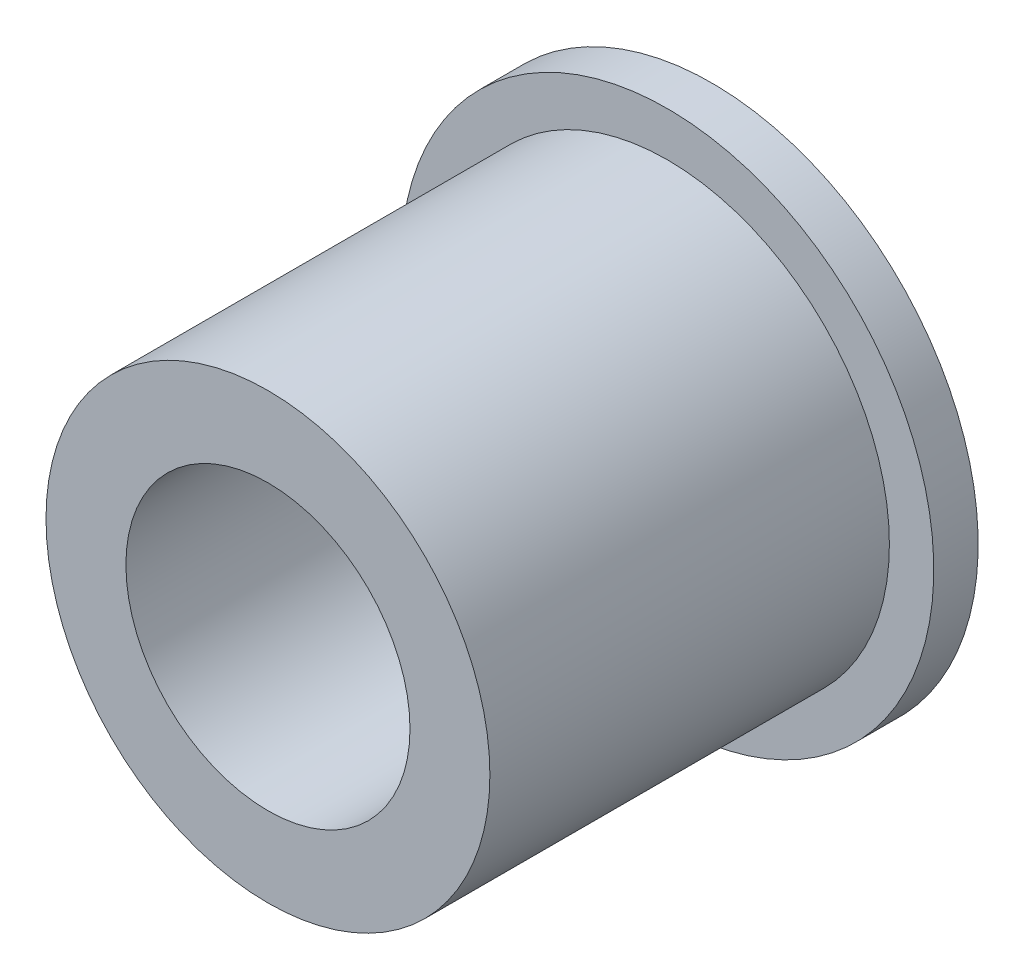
from build123d import *

# Parameters (mm, degrees)
ESQUISSE1_R      = 25
ESQUISSE1_R_2    = 16
EXTRUSION1_DEPTH = 50
ESQUISSE3_R      = 30
ESQUISSE3_R_2    = 25
EXTRUSION3_DEPTH = 5


with BuildPart() as part:
    # Esquisse1 → Extrusion1 (new body)
    with BuildSketch(Plane.XY):
        Circle(ESQUISSE1_R)
        Circle(ESQUISSE1_R_2, mode=Mode.SUBTRACT)
    extrude(amount=EXTRUSION1_DEPTH)

    # Esquisse3 → Extrusion3 (add)
    with BuildSketch(Plane(origin=(0, 0, 0), x_dir=(-1, 0, 0), z_dir=(0, 0, -1))):
        Circle(ESQUISSE3_R)
        Circle(ESQUISSE3_R_2, mode=Mode.SUBTRACT)
    extrude(amount=-EXTRUSION3_DEPTH)


solid = part.part
